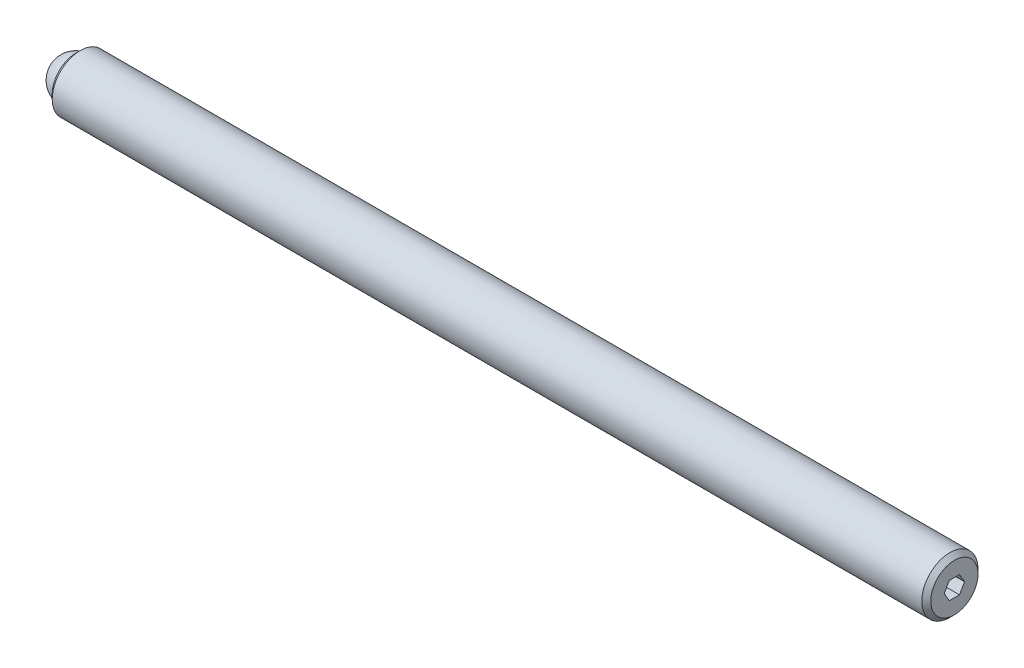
from build123d import *

# Parameters (mm, degrees)
SKETCH2_R           = 3.175
BOSS_EXTRUDE1_DEPTH = 99.21875
CHAMFER1_SIZE       = 0.508
CHAMFER2_SIZE       = 0.508
CUT_EXTRUDE2_DEPTH  = 2.286
SKETCH3_R           = 2.38125
CUT_EXTRUDE3_DEPTH  = 1.984375


with BuildPart() as part:
    # Sketch2 → Boss-Extrude1 (new body)
    with BuildSketch(Plane(origin=(0, 0, 0), x_dir=(0, 0, -1), z_dir=(1, 0, 0))):
        with Locations(Location((0, 0, 0), (0, 0, 180))):
            Circle(SKETCH2_R)
    extrude(amount=BOSS_EXTRUDE1_DEPTH)

    # Chamfer1
    chamfer1_edges = [part.edges().sort_by_distance(p)[0] for p in [
        (0, 0, -3.175),
    ]]
    chamfer(chamfer1_edges, length=CHAMFER1_SIZE)

    # Chamfer2
    chamfer2_edges = [part.edges().sort_by_distance(p)[0] for p in [
        (99.21875, 0, -3.175),
    ]]
    chamfer(chamfer2_edges, length=CHAMFER2_SIZE)

    # Sketch4 → Cut-Extrude2 (cut)
    with BuildSketch(Plane(origin=(99.21875, 0, 0), x_dir=(0, 0, -1), z_dir=(1, 0, 0))):
        Polygon((1.14567944, 0), (0.57283972, 0.9921875), (-0.57283972, 0.9921875), (-1.14567944, 0), (-0.57283972, -0.9921875), (0.57283972, -0.9921875), align=None)
    extrude(amount=-CUT_EXTRUDE2_DEPTH, mode=Mode.SUBTRACT)

    # Sketch3 → Cut-Extrude3 (cut)
    with BuildSketch(Plane.ZY):
        Circle(SKETCH3_R)
    extrude(amount=-CUT_EXTRUDE3_DEPTH, mode=Mode.SUBTRACT)


with BuildPart() as body_2:
    # Sketch5 → Revolve1 (revolve)
    with BuildSketch(Plane.ZY):
        with BuildLine():
            Line((0, 0), (0, -2.38125))
            ThreePointArc((0, -2.38125), (-2.38125, 0), (0, 2.38125))
            Line((0, 2.38125), (0, 0))
        make_face()
    revolve(axis=Axis((0, 0, 0), (0, 1, 0)))


solid = Compound([part.part, body_2.part])
